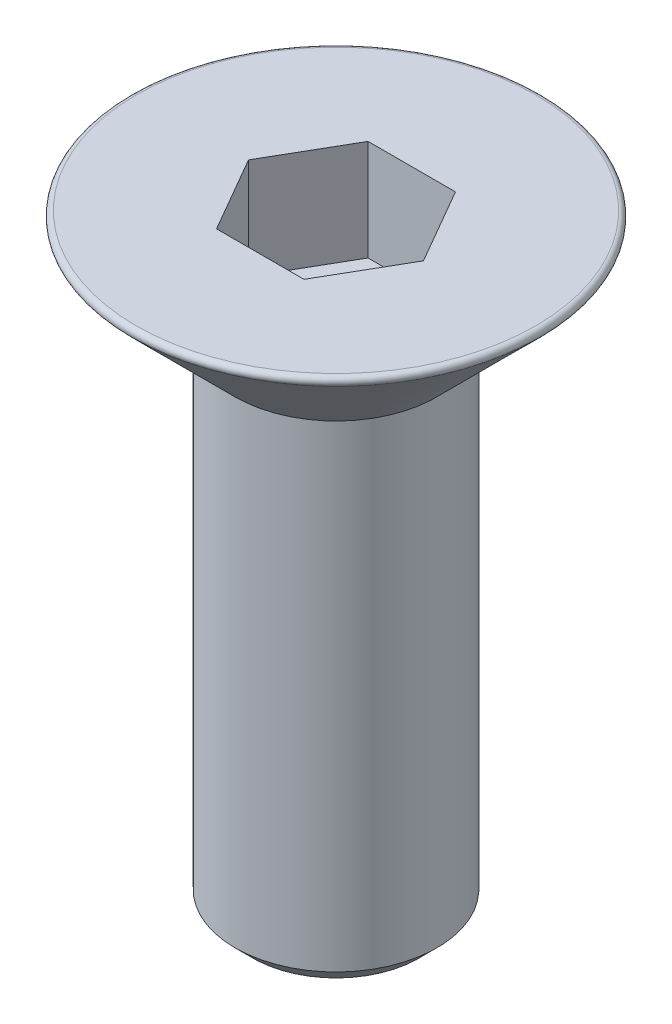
from build123d import *

# Parameters (mm, degrees)
ENL_V_MAT_EXTRU_1_DEPTH = 2
CHANFREIN1_SIZE         = 0.35
CONG_1_R                = 0.1


with BuildPart() as part:
    # Esquisse1 → Base-R_volution (revolve)
    with BuildSketch(Plane.XY, mode=Mode.PRIVATE) as base_r_volution_sk:
        Polygon((0, 0), (4.2, 0), (2, -2.2), (2, -12), (0, -12), align=None)
    revolve(base_r_volution_sk.sketch.rotate(Axis((0, 7.35066637, 0), (0, -1, 0)), 90), axis=Axis((0, 7.35066637, 0), (0, -1, 0)))

    # Esquisse2 → Enl_v. mat.-Extru.1 (cut)
    with BuildSketch(Plane(origin=(-0.418409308, 0, 2.094233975), x_dir=(-1, 0, 0), z_dir=(0, 1, 0))):
        Polygon((0.447616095, -0.594233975), (1.313641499, -2.094233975), (0.447616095, -3.594233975), (-1.284434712, -3.594233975), (-2.150460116, -2.094233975), (-1.284434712, -0.594233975), align=None)
    extrude(amount=-ENL_V_MAT_EXTRU_1_DEPTH, mode=Mode.SUBTRACT)

    # Chanfrein1
    chanfrein1_edges = [part.edges().sort_by_distance(p)[0] for p in [
        (0, -12, -2),
    ]]
    chamfer(chanfrein1_edges, length=CHANFREIN1_SIZE)

    # Cong_1
    cong_1_edges = [part.edges().sort_by_distance(p)[0] for p in [
        (0, 0, -4.2),
    ]]
    fillet(cong_1_edges, radius=CONG_1_R)


solid = part.part
